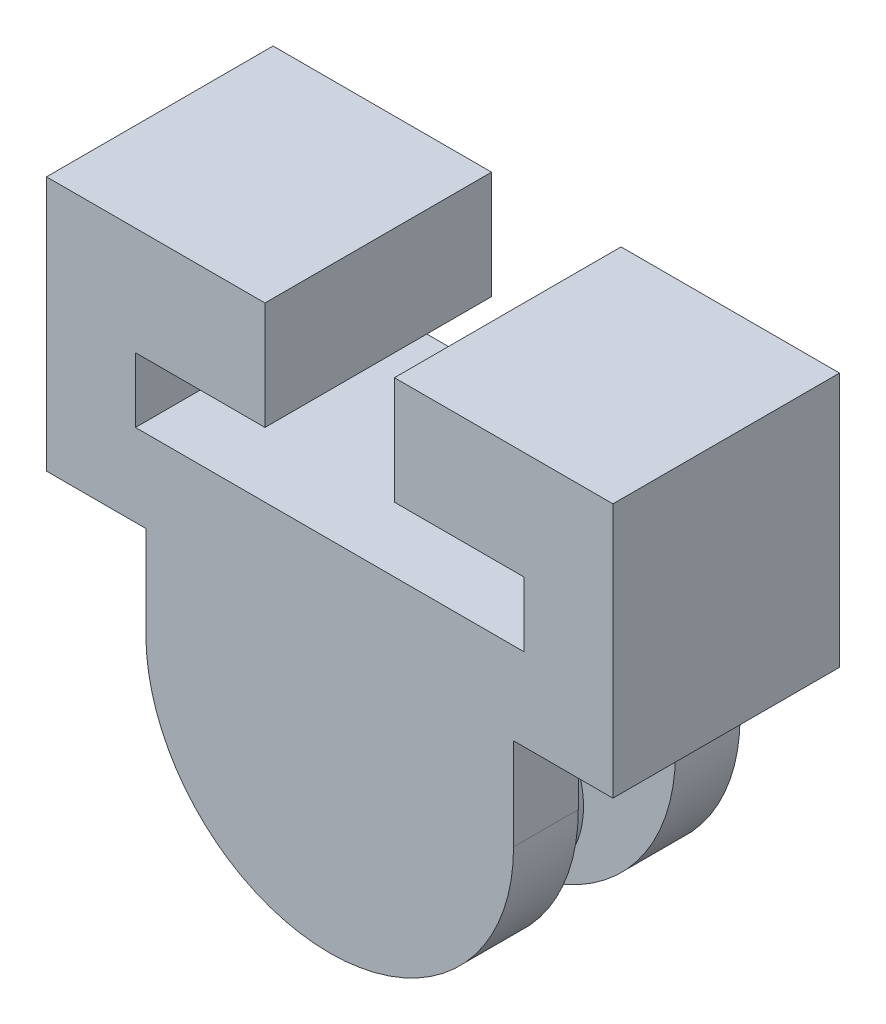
from build123d import *

# Parameters (mm, degrees)
SECTION_B_DEPTH              = 12.7
SKETCH3_R                    = 18.033201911
SECTION_A_DEPTH              = 19.05
SKETCH4_W                    = 111.125
SKETCH4_H                    = 16.151959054
SECTION_C_DEPTH              = 31.75
SKETCH5_W                    = 17.4625
SKETCH5_H                    = 12.7
SECTION_D_DEPTH              = 31.75
SKETCH6_W                    = 42.8625
SKETCH6_H                    = 21.154312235
SECTION_E_DEPTH              = 31.75
FINAL_DESIGN_ITERATION_DEPTH = 12.7


with BuildPart() as part:
    # Sketch1 → Section B (new body)
    with BuildSketch(Plane.XY):
        with BuildLine():
            Line((-36.066403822, 36.066403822), (-36.066403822, 54.099605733))
            Line((-36.066403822, 54.099605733), (36.066403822, 54.099605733))
            Line((36.066403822, 54.099605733), (36.066403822, 36.066403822))
            ThreePointArc((36.066403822, 36.066403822), (0, 0), (-36.066403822, 36.066403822))
        make_face()
    extrude(amount=SECTION_B_DEPTH)

    # Sketch3 → Section A (add)
    with BuildSketch(Plane.XY.offset(12.7)):
        with Locations(Location((0, 18.033201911, 0), (0, 0, 269.999730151))):
            Circle(SKETCH3_R)
    extrude(amount=SECTION_A_DEPTH)

    # Sketch4 → Section C (add)
    with BuildSketch(Plane.XY):
        with Locations((0, 62.17558526)):
            Rectangle(SKETCH4_W, SKETCH4_H)
    extrude(amount=SECTION_C_DEPTH)

    # Sketch5 → Section D (add)
    with BuildSketch(Plane.XY):
        with Locations((46.83125, 76.601564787)):
            Rectangle(SKETCH5_W, SKETCH5_H)
        with Locations((-46.83125, 76.601564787)):
            Rectangle(SKETCH5_W, SKETCH5_H)
    extrude(amount=SECTION_D_DEPTH)

    # Sketch6 → Section E (add)
    with BuildSketch(Plane.XY):
        with Locations((34.13125, 93.528720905)):
            Rectangle(SKETCH6_W, SKETCH6_H)
        with Locations((-34.13125, 93.528720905)):
            Rectangle(SKETCH6_W, SKETCH6_H)
    extrude(amount=SECTION_E_DEPTH)

    # Sketch8 → Final Design Iteration (add)
    with BuildSketch(Plane.XY.offset(31.75)):
        with BuildLine():
            Line((-12.7, 104.105877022), (-55.5625, 104.105877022))
            Line((-55.5625, 104.105877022), (-55.5625, 54.099605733))
            Line((-55.5625, 54.099605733), (-36.066403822, 54.099605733))
            Line((-36.066403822, 54.099605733), (-36.066403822, 36.066403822))
            ThreePointArc((-36.066403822, 36.066403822), (0, 0), (36.066403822, 36.066403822))
            Line((36.066403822, 36.066403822), (36.066403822, 54.099605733))
            Line((36.066403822, 54.099605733), (55.5625, 54.099605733))
            Line((55.5625, 54.099605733), (55.5625, 104.105877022))
            Line((55.5625, 104.105877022), (12.7, 104.105877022))
            Line((12.7, 104.105877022), (12.7, 82.951564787))
            Line((12.7, 82.951564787), (38.1, 82.951564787))
            Line((38.1, 82.951564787), (38.1, 70.251564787))
            Line((38.1, 70.251564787), (-38.1, 70.251564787))
            Line((-38.1, 70.251564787), (-38.1, 82.951564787))
            Line((-38.1, 82.951564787), (-12.7, 82.951564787))
            Line((-12.7, 82.951564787), (-12.7, 104.105877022))
        make_face()
    extrude(amount=FINAL_DESIGN_ITERATION_DEPTH)


solid = part.part
